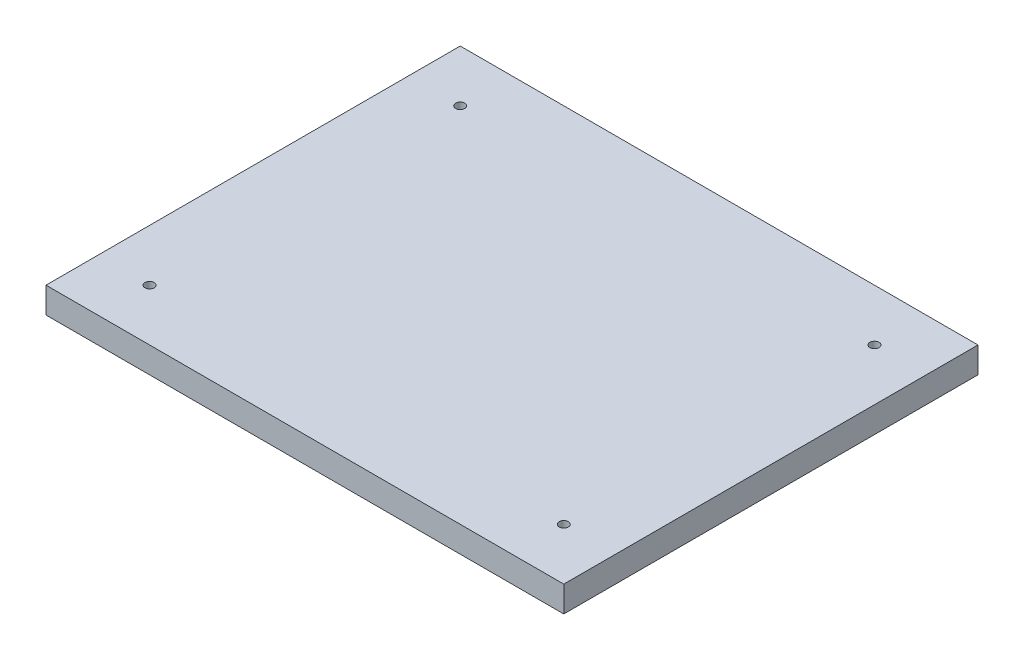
ISO-10303-21;
HEADER;
FILE_DESCRIPTION(('STEP AP214'),'2;1');
FILE_NAME('part.step','',(''),(''),'','','');
FILE_SCHEMA(('AUTOMOTIVE_DESIGN { 1 0 10303 214 1 1 1 1 }'));
ENDSEC;
DATA;
#1=APPLICATION_CONTEXT('core data for automotive mechanical design processes');
#2=APPLICATION_PROTOCOL_DEFINITION('international standard','automotive_design',2000,#1);
#3=PRODUCT_CONTEXT('',#1,'mechanical');
#4=PRODUCT('Part','Part','',(#3));
#5=PRODUCT_RELATED_PRODUCT_CATEGORY('part','',(#4));
#6=PRODUCT_DEFINITION_FORMATION('','',#4);
#7=PRODUCT_DEFINITION_CONTEXT('part definition',#1,'design');
#8=PRODUCT_DEFINITION('design','',#6,#7);
#9=PRODUCT_DEFINITION_SHAPE('','',#8);
#10=(LENGTH_UNIT() NAMED_UNIT(*) SI_UNIT(.MILLI.,.METRE.));
#11=(NAMED_UNIT(*) PLANE_ANGLE_UNIT() SI_UNIT($,.RADIAN.));
#12=(NAMED_UNIT(*) SI_UNIT($,.STERADIAN.) SOLID_ANGLE_UNIT());
#13=UNCERTAINTY_MEASURE_WITH_UNIT(LENGTH_MEASURE(1.E-05),#10,'distance_accuracy_value','');
#14=(GEOMETRIC_REPRESENTATION_CONTEXT(3) GLOBAL_UNCERTAINTY_ASSIGNED_CONTEXT((#13)) GLOBAL_UNIT_ASSIGNED_CONTEXT((#10,
#11,#12)) REPRESENTATION_CONTEXT('',''));
#15=CARTESIAN_POINT('',(0.,0.,0.));
#16=DIRECTION('',(0.,0.,1.));
#17=DIRECTION('',(1.,0.,0.));
#18=AXIS2_PLACEMENT_3D('',#15,#16,#17);
#19=CARTESIAN_POINT('',(-32.5941065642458,6.35,-28.8750818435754));
#20=DIRECTION('',(1.,0.,0.));
#21=DIRECTION('',(0.,0.,-1.));
#22=AXIS2_PLACEMENT_3D('',#19,#20,#21);
#23=PLANE('',#22);
#24=DIRECTION('',(0.,0.,1.));
#25=VECTOR('',#24,1.);
#26=CARTESIAN_POINT('',(-32.5941065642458,0.,-28.8750818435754));
#27=LINE('',#26,#25);
#28=CARTESIAN_POINT('',(-32.5941065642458,0.,-28.8750818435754));
#29=VERTEX_POINT('',#28);
#30=CARTESIAN_POINT('',(-32.5941065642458,0.,72.7249181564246));
#31=VERTEX_POINT('',#30);
#32=EDGE_CURVE('E102',#29,#31,#27,.T.);
#33=ORIENTED_EDGE('',*,*,#32,.T.);
#34=DIRECTION('',(0.,-1.,0.));
#35=VECTOR('',#34,1.);
#36=CARTESIAN_POINT('',(-32.5941065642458,6.35,72.7249181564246));
#37=LINE('',#36,#35);
#38=CARTESIAN_POINT('',(-32.5941065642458,6.35,72.7249181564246));
#39=VERTEX_POINT('',#38);
#40=EDGE_CURVE('E11',#39,#31,#37,.T.);
#41=ORIENTED_EDGE('',*,*,#40,.F.);
#42=DIRECTION('',(0.,0.,1.));
#43=VECTOR('',#42,1.);
#44=CARTESIAN_POINT('',(-32.5941065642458,6.35,-28.8750818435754));
#45=LINE('',#44,#43);
#46=CARTESIAN_POINT('',(-32.5941065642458,6.35,-28.8750818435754));
#47=VERTEX_POINT('',#46);
#48=EDGE_CURVE('E89',#47,#39,#45,.T.);
#49=ORIENTED_EDGE('',*,*,#48,.F.);
#50=DIRECTION('',(0.,-1.,0.));
#51=VECTOR('',#50,1.);
#52=CARTESIAN_POINT('',(-32.5941065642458,6.35,-28.8750818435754));
#53=LINE('',#52,#51);
#54=EDGE_CURVE('E98',#47,#29,#53,.T.);
#55=ORIENTED_EDGE('',*,*,#54,.T.);
#56=EDGE_LOOP('',(#33,#41,#49,#55));
#57=FACE_BOUND('',#56,.T.);
#58=ADVANCED_FACE('F36',(#57),#23,.F.);
#59=CARTESIAN_POINT('',(-32.5941065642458,6.35,72.7249181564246));
#60=DIRECTION('',(0.,0.,-1.));
#61=DIRECTION('',(-1.,0.,0.));
#62=AXIS2_PLACEMENT_3D('',#59,#60,#61);
#63=PLANE('',#62);
#64=DIRECTION('',(1.,0.,0.));
#65=VECTOR('',#64,1.);
#66=CARTESIAN_POINT('',(-32.5941065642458,0.,72.7249181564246));
#67=LINE('',#66,#65);
#68=CARTESIAN_POINT('',(94.4058934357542,0.,72.7249181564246));
#69=VERTEX_POINT('',#68);
#70=EDGE_CURVE('E93',#31,#69,#67,.T.);
#71=ORIENTED_EDGE('',*,*,#70,.T.);
#72=DIRECTION('',(0.,-1.,0.));
#73=VECTOR('',#72,1.);
#74=CARTESIAN_POINT('',(94.4058934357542,6.35,72.7249181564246));
#75=LINE('',#74,#73);
#76=CARTESIAN_POINT('',(94.4058934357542,6.35,72.7249181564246));
#77=VERTEX_POINT('',#76);
#78=EDGE_CURVE('E45',#77,#69,#75,.T.);
#79=ORIENTED_EDGE('',*,*,#78,.F.);
#80=DIRECTION('',(1.,0.,0.));
#81=VECTOR('',#80,1.);
#82=CARTESIAN_POINT('',(-32.5941065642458,6.35,72.7249181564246));
#83=LINE('',#82,#81);
#84=EDGE_CURVE('E84',#39,#77,#83,.T.);
#85=ORIENTED_EDGE('',*,*,#84,.F.);
#86=ORIENTED_EDGE('',*,*,#40,.T.);
#87=EDGE_LOOP('',(#71,#79,#85,#86));
#88=FACE_BOUND('',#87,.T.);
#89=ADVANCED_FACE('F92',(#88),#63,.F.);
#90=CARTESIAN_POINT('',(94.4058934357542,6.35,-28.8750818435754));
#91=DIRECTION('',(-1.,0.,0.));
#92=DIRECTION('',(0.,0.,1.));
#93=AXIS2_PLACEMENT_3D('',#90,#91,#92);
#94=PLANE('',#93);
#95=DIRECTION('',(0.,0.,-1.));
#96=VECTOR('',#95,1.);
#97=CARTESIAN_POINT('',(94.4058934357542,0.,-28.8750818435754));
#98=LINE('',#97,#96);
#99=CARTESIAN_POINT('',(94.4058934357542,0.,-28.8750818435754));
#100=VERTEX_POINT('',#99);
#101=EDGE_CURVE('E71',#69,#100,#98,.T.);
#102=ORIENTED_EDGE('',*,*,#101,.T.);
#103=DIRECTION('',(0.,-1.,0.));
#104=VECTOR('',#103,1.);
#105=CARTESIAN_POINT('',(94.4058934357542,6.35,-28.8750818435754));
#106=LINE('',#105,#104);
#107=CARTESIAN_POINT('',(94.4058934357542,6.35,-28.8750818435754));
#108=VERTEX_POINT('',#107);
#109=EDGE_CURVE('E94',#108,#100,#106,.T.);
#110=ORIENTED_EDGE('',*,*,#109,.F.);
#111=DIRECTION('',(0.,0.,-1.));
#112=VECTOR('',#111,1.);
#113=CARTESIAN_POINT('',(94.4058934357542,6.35,-28.8750818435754));
#114=LINE('',#113,#112);
#115=EDGE_CURVE('E87',#77,#108,#114,.T.);
#116=ORIENTED_EDGE('',*,*,#115,.F.);
#117=ORIENTED_EDGE('',*,*,#78,.T.);
#118=EDGE_LOOP('',(#102,#110,#116,#117));
#119=FACE_BOUND('',#118,.T.);
#120=ADVANCED_FACE('F96',(#119),#94,.F.);
#121=CARTESIAN_POINT('',(-32.5941065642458,6.35,-28.8750818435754));
#122=DIRECTION('',(0.,0.,1.));
#123=DIRECTION('',(1.,0.,0.));
#124=AXIS2_PLACEMENT_3D('',#121,#122,#123);
#125=PLANE('',#124);
#126=DIRECTION('',(-1.,0.,0.));
#127=VECTOR('',#126,1.);
#128=CARTESIAN_POINT('',(-32.5941065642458,0.,-28.8750818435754));
#129=LINE('',#128,#127);
#130=EDGE_CURVE('E77',#100,#29,#129,.T.);
#131=ORIENTED_EDGE('',*,*,#130,.T.);
#132=ORIENTED_EDGE('',*,*,#54,.F.);
#133=DIRECTION('',(-1.,0.,0.));
#134=VECTOR('',#133,1.);
#135=CARTESIAN_POINT('',(-32.5941065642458,6.35,-28.8750818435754));
#136=LINE('',#135,#134);
#137=EDGE_CURVE('E54',#108,#47,#136,.T.);
#138=ORIENTED_EDGE('',*,*,#137,.F.);
#139=ORIENTED_EDGE('',*,*,#109,.T.);
#140=EDGE_LOOP('',(#131,#132,#138,#139));
#141=FACE_BOUND('',#140,.T.);
#142=ADVANCED_FACE('F140',(#141),#125,.F.);
#143=CARTESIAN_POINT('',(-32.5941065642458,6.35,72.7249181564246));
#144=DIRECTION('',(0.,1.,0.));
#145=DIRECTION('',(0.,0.,1.));
#146=AXIS2_PLACEMENT_3D('',#143,#144,#145);
#147=PLANE('',#146);
#148=CARTESIAN_POINT('',(-19.8941065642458,6.35,60.0249181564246));
#149=DIRECTION('',(0.,1.,0.));
#150=DIRECTION('',(0.,0.,1.));
#151=AXIS2_PLACEMENT_3D('',#148,#149,#150);
#152=CIRCLE('',#151,1.13029999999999);
#153=CARTESIAN_POINT('',(-19.8941065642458,6.35,61.1552181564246));
#154=VERTEX_POINT('',#153);
#155=EDGE_CURVE('E129',#154,#154,#152,.T.);
#156=ORIENTED_EDGE('',*,*,#155,.F.);
#157=EDGE_LOOP('',(#156));
#158=FACE_BOUND('',#157,.T.);
#159=CARTESIAN_POINT('',(-19.8941065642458,6.35,-16.1750818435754));
#160=DIRECTION('',(0.,1.,0.));
#161=DIRECTION('',(0.,0.,1.));
#162=AXIS2_PLACEMENT_3D('',#159,#160,#161);
#163=CIRCLE('',#162,1.13029999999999);
#164=CARTESIAN_POINT('',(-19.8941065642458,6.35,-15.0447818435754));
#165=VERTEX_POINT('',#164);
#166=EDGE_CURVE('E119',#165,#165,#163,.T.);
#167=ORIENTED_EDGE('',*,*,#166,.F.);
#168=EDGE_LOOP('',(#167));
#169=FACE_BOUND('',#168,.T.);
#170=CARTESIAN_POINT('',(81.7058934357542,6.35,-16.1750818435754));
#171=DIRECTION('',(0.,1.,0.));
#172=DIRECTION('',(0.,0.,1.));
#173=AXIS2_PLACEMENT_3D('',#170,#171,#172);
#174=CIRCLE('',#173,1.13029999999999);
#175=CARTESIAN_POINT('',(81.7058934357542,6.35,-15.0447818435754));
#176=VERTEX_POINT('',#175);
#177=EDGE_CURVE('E116',#176,#176,#174,.T.);
#178=ORIENTED_EDGE('',*,*,#177,.F.);
#179=EDGE_LOOP('',(#178));
#180=FACE_BOUND('',#179,.T.);
#181=CARTESIAN_POINT('',(81.7058934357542,6.35,60.0249181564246));
#182=DIRECTION('',(0.,1.,0.));
#183=DIRECTION('',(0.,0.,1.));
#184=AXIS2_PLACEMENT_3D('',#181,#182,#183);
#185=CIRCLE('',#184,1.13029999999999);
#186=CARTESIAN_POINT('',(81.7058934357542,6.35,61.1552181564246));
#187=VERTEX_POINT('',#186);
#188=EDGE_CURVE('E113',#187,#187,#185,.T.);
#189=ORIENTED_EDGE('',*,*,#188,.F.);
#190=EDGE_LOOP('',(#189));
#191=FACE_BOUND('',#190,.T.);
#192=ORIENTED_EDGE('',*,*,#48,.T.);
#193=ORIENTED_EDGE('',*,*,#84,.T.);
#194=ORIENTED_EDGE('',*,*,#115,.T.);
#195=ORIENTED_EDGE('',*,*,#137,.T.);
#196=EDGE_LOOP('',(#192,#193,#194,#195));
#197=FACE_BOUND('',#196,.T.);
#198=ADVANCED_FACE('F85',(#158,#169,#180,#191,#197),#147,.T.);
#199=CARTESIAN_POINT('',(-32.5941065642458,0.,72.7249181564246));
#200=DIRECTION('',(0.,1.,0.));
#201=DIRECTION('',(0.,0.,1.));
#202=AXIS2_PLACEMENT_3D('',#199,#200,#201);
#203=PLANE('',#202);
#204=CARTESIAN_POINT('',(-19.8941065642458,0.,60.0249181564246));
#205=DIRECTION('',(0.,1.,0.));
#206=DIRECTION('',(0.,0.,1.));
#207=AXIS2_PLACEMENT_3D('',#204,#205,#206);
#208=CIRCLE('',#207,1.13029999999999);
#209=CARTESIAN_POINT('',(-19.8941065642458,0.,61.1552181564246));
#210=VERTEX_POINT('',#209);
#211=EDGE_CURVE('E39',#210,#210,#208,.T.);
#212=ORIENTED_EDGE('',*,*,#211,.T.);
#213=EDGE_LOOP('',(#212));
#214=FACE_BOUND('',#213,.T.);
#215=CARTESIAN_POINT('',(-19.8941065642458,0.,-16.1750818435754));
#216=DIRECTION('',(0.,1.,0.));
#217=DIRECTION('',(0.,0.,1.));
#218=AXIS2_PLACEMENT_3D('',#215,#216,#217);
#219=CIRCLE('',#218,1.13029999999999);
#220=CARTESIAN_POINT('',(-19.8941065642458,0.,-15.0447818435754));
#221=VERTEX_POINT('',#220);
#222=EDGE_CURVE('E117',#221,#221,#219,.T.);
#223=ORIENTED_EDGE('',*,*,#222,.T.);
#224=EDGE_LOOP('',(#223));
#225=FACE_BOUND('',#224,.T.);
#226=CARTESIAN_POINT('',(81.7058934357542,0.,-16.1750818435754));
#227=DIRECTION('',(0.,1.,0.));
#228=DIRECTION('',(0.,0.,1.));
#229=AXIS2_PLACEMENT_3D('',#226,#227,#228);
#230=CIRCLE('',#229,1.13029999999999);
#231=CARTESIAN_POINT('',(81.7058934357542,0.,-15.0447818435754));
#232=VERTEX_POINT('',#231);
#233=EDGE_CURVE('E114',#232,#232,#230,.T.);
#234=ORIENTED_EDGE('',*,*,#233,.T.);
#235=EDGE_LOOP('',(#234));
#236=FACE_BOUND('',#235,.T.);
#237=CARTESIAN_POINT('',(81.7058934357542,0.,60.0249181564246));
#238=DIRECTION('',(0.,1.,0.));
#239=DIRECTION('',(0.,0.,1.));
#240=AXIS2_PLACEMENT_3D('',#237,#238,#239);
#241=CIRCLE('',#240,1.13029999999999);
#242=CARTESIAN_POINT('',(81.7058934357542,0.,61.1552181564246));
#243=VERTEX_POINT('',#242);
#244=EDGE_CURVE('E105',#243,#243,#241,.T.);
#245=ORIENTED_EDGE('',*,*,#244,.T.);
#246=EDGE_LOOP('',(#245));
#247=FACE_BOUND('',#246,.T.);
#248=ORIENTED_EDGE('',*,*,#32,.F.);
#249=ORIENTED_EDGE('',*,*,#130,.F.);
#250=ORIENTED_EDGE('',*,*,#101,.F.);
#251=ORIENTED_EDGE('',*,*,#70,.F.);
#252=EDGE_LOOP('',(#248,#249,#250,#251));
#253=FACE_BOUND('',#252,.T.);
#254=ADVANCED_FACE('F139',(#214,#225,#236,#247,#253),#203,.F.);
#255=CARTESIAN_POINT('',(81.7058934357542,6.35,60.0249181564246));
#256=DIRECTION('',(0.,1.,0.));
#257=DIRECTION('',(0.,0.,1.));
#258=AXIS2_PLACEMENT_3D('',#255,#256,#257);
#259=CYLINDRICAL_SURFACE('',#258,1.13029999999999);
#260=ORIENTED_EDGE('',*,*,#188,.T.);
#261=EDGE_LOOP('',(#260));
#262=FACE_BOUND('',#261,.T.);
#263=ORIENTED_EDGE('',*,*,#244,.F.);
#264=EDGE_LOOP('',(#263));
#265=FACE_BOUND('',#264,.T.);
#266=ADVANCED_FACE('F135',(#262,#265),#259,.F.);
#267=CARTESIAN_POINT('',(81.7058934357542,6.35,-16.1750818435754));
#268=DIRECTION('',(0.,1.,0.));
#269=DIRECTION('',(0.,0.,1.));
#270=AXIS2_PLACEMENT_3D('',#267,#268,#269);
#271=CYLINDRICAL_SURFACE('',#270,1.13029999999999);
#272=ORIENTED_EDGE('',*,*,#177,.T.);
#273=EDGE_LOOP('',(#272));
#274=FACE_BOUND('',#273,.T.);
#275=ORIENTED_EDGE('',*,*,#233,.F.);
#276=EDGE_LOOP('',(#275));
#277=FACE_BOUND('',#276,.T.);
#278=ADVANCED_FACE('F190',(#274,#277),#271,.F.);
#279=CARTESIAN_POINT('',(-19.8941065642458,6.35,-16.1750818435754));
#280=DIRECTION('',(0.,1.,0.));
#281=DIRECTION('',(0.,0.,1.));
#282=AXIS2_PLACEMENT_3D('',#279,#280,#281);
#283=CYLINDRICAL_SURFACE('',#282,1.13029999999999);
#284=ORIENTED_EDGE('',*,*,#166,.T.);
#285=EDGE_LOOP('',(#284));
#286=FACE_BOUND('',#285,.T.);
#287=ORIENTED_EDGE('',*,*,#222,.F.);
#288=EDGE_LOOP('',(#287));
#289=FACE_BOUND('',#288,.T.);
#290=ADVANCED_FACE('F200',(#286,#289),#283,.F.);
#291=CARTESIAN_POINT('',(-19.8941065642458,6.35,60.0249181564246));
#292=DIRECTION('',(0.,1.,0.));
#293=DIRECTION('',(0.,0.,1.));
#294=AXIS2_PLACEMENT_3D('',#291,#292,#293);
#295=CYLINDRICAL_SURFACE('',#294,1.13029999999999);
#296=ORIENTED_EDGE('',*,*,#155,.T.);
#297=EDGE_LOOP('',(#296));
#298=FACE_BOUND('',#297,.T.);
#299=ORIENTED_EDGE('',*,*,#211,.F.);
#300=EDGE_LOOP('',(#299));
#301=FACE_BOUND('',#300,.T.);
#302=ADVANCED_FACE('F212',(#298,#301),#295,.F.);
#303=CLOSED_SHELL('',(#58,#89,#120,#142,#198,#254,#266,#278,#290,#302));
#304=MANIFOLD_SOLID_BREP('B2',#303);
#305=ADVANCED_BREP_SHAPE_REPRESENTATION('',(#18,#304),#14);
#306=SHAPE_DEFINITION_REPRESENTATION(#9,#305);
ENDSEC;
END-ISO-10303-21;
